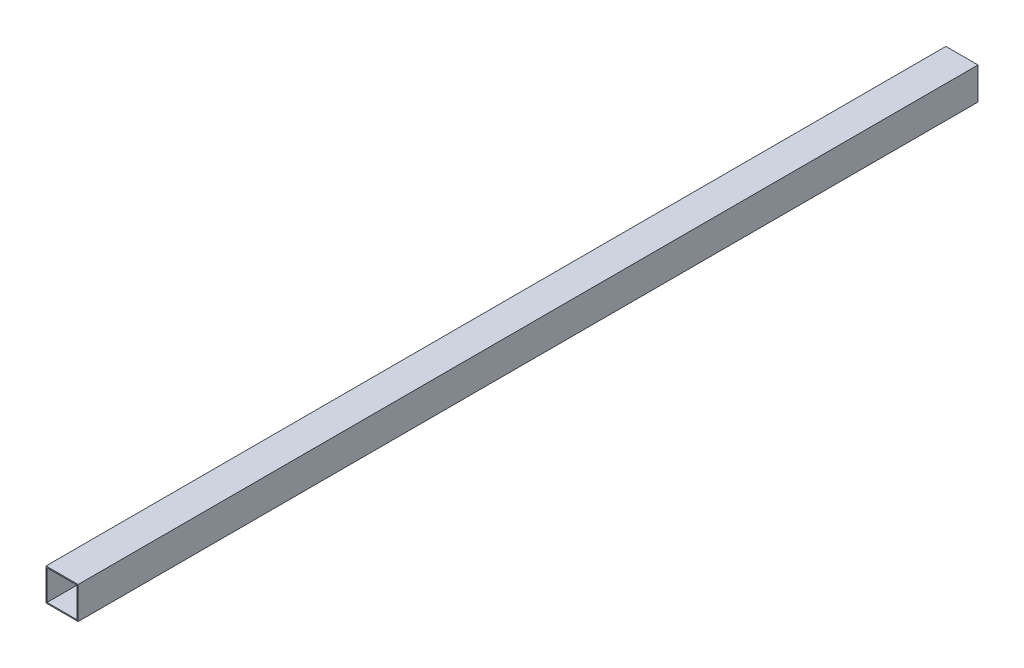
ISO-10303-21;
HEADER;
FILE_DESCRIPTION(('STEP AP214'),'2;1');
FILE_NAME('part.step','',(''),(''),'','','');
FILE_SCHEMA(('AUTOMOTIVE_DESIGN { 1 0 10303 214 1 1 1 1 }'));
ENDSEC;
DATA;
#1=APPLICATION_CONTEXT('core data for automotive mechanical design processes');
#2=APPLICATION_PROTOCOL_DEFINITION('international standard','automotive_design',2000,#1);
#3=PRODUCT_CONTEXT('',#1,'mechanical');
#4=PRODUCT('Part','Part','',(#3));
#5=PRODUCT_RELATED_PRODUCT_CATEGORY('part','',(#4));
#6=PRODUCT_DEFINITION_FORMATION('','',#4);
#7=PRODUCT_DEFINITION_CONTEXT('part definition',#1,'design');
#8=PRODUCT_DEFINITION('design','',#6,#7);
#9=PRODUCT_DEFINITION_SHAPE('','',#8);
#10=(LENGTH_UNIT() NAMED_UNIT(*) SI_UNIT(.MILLI.,.METRE.));
#11=(NAMED_UNIT(*) PLANE_ANGLE_UNIT() SI_UNIT($,.RADIAN.));
#12=(NAMED_UNIT(*) SI_UNIT($,.STERADIAN.) SOLID_ANGLE_UNIT());
#13=UNCERTAINTY_MEASURE_WITH_UNIT(LENGTH_MEASURE(1.E-05),#10,'distance_accuracy_value','');
#14=(GEOMETRIC_REPRESENTATION_CONTEXT(3) GLOBAL_UNCERTAINTY_ASSIGNED_CONTEXT((#13)) GLOBAL_UNIT_ASSIGNED_CONTEXT((#10,
#11,#12)) REPRESENTATION_CONTEXT('',''));
#15=CARTESIAN_POINT('',(0.,0.,0.));
#16=DIRECTION('',(0.,0.,1.));
#17=DIRECTION('',(1.,0.,0.));
#18=AXIS2_PLACEMENT_3D('',#15,#16,#17);
#19=CARTESIAN_POINT('',(1.11022302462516E-13,0.,840.));
#20=DIRECTION('',(0.,0.,1.));
#21=DIRECTION('',(1.,0.,0.));
#22=AXIS2_PLACEMENT_3D('',#19,#20,#21);
#23=PLANE('',#22);
#24=DIRECTION('',(0.,1.,0.));
#25=VECTOR('',#24,1.);
#26=CARTESIAN_POINT('',(15.0000000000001,-14.9999999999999,840.));
#27=LINE('',#26,#25);
#28=CARTESIAN_POINT('',(15.0000000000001,-14.9999999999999,840.));
#29=VERTEX_POINT('',#28);
#30=CARTESIAN_POINT('',(14.9999999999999,15.,840.));
#31=VERTEX_POINT('',#30);
#32=EDGE_CURVE('E161',#29,#31,#27,.T.);
#33=ORIENTED_EDGE('',*,*,#32,.T.);
#34=DIRECTION('',(-1.,0.,0.));
#35=VECTOR('',#34,1.);
#36=CARTESIAN_POINT('',(-14.9999999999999,15.0000000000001,840.));
#37=LINE('',#36,#35);
#38=CARTESIAN_POINT('',(-14.9999999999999,15.0000000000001,840.));
#39=VERTEX_POINT('',#38);
#40=EDGE_CURVE('E164',#31,#39,#37,.T.);
#41=ORIENTED_EDGE('',*,*,#40,.T.);
#42=DIRECTION('',(0.,-1.,0.));
#43=VECTOR('',#42,1.);
#44=CARTESIAN_POINT('',(-14.9999999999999,-15.,840.));
#45=LINE('',#44,#43);
#46=CARTESIAN_POINT('',(-14.9999999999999,-15.,840.));
#47=VERTEX_POINT('',#46);
#48=EDGE_CURVE('E167',#39,#47,#45,.T.);
#49=ORIENTED_EDGE('',*,*,#48,.T.);
#50=DIRECTION('',(1.,0.,0.));
#51=VECTOR('',#50,1.);
#52=CARTESIAN_POINT('',(-14.9999999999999,-15.,840.));
#53=LINE('',#52,#51);
#54=EDGE_CURVE('E169',#47,#29,#53,.T.);
#55=ORIENTED_EDGE('',*,*,#54,.T.);
#56=EDGE_LOOP('',(#33,#41,#49,#55));
#57=FACE_BOUND('',#56,.T.);
#58=DIRECTION('',(-1.,0.,0.));
#59=VECTOR('',#58,1.);
#60=CARTESIAN_POINT('',(1.11022302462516E-13,14.,840.));
#61=LINE('',#60,#59);
#62=CARTESIAN_POINT('',(13.9999999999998,14.,840.));
#63=VERTEX_POINT('',#62);
#64=CARTESIAN_POINT('',(-14.0000000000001,14.0000000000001,840.));
#65=VERTEX_POINT('',#64);
#66=EDGE_CURVE('E133',#63,#65,#61,.T.);
#67=ORIENTED_EDGE('',*,*,#66,.F.);
#68=DIRECTION('',(0.,1.,0.));
#69=VECTOR('',#68,1.);
#70=CARTESIAN_POINT('',(14.0000000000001,0.,840.));
#71=LINE('',#70,#69);
#72=CARTESIAN_POINT('',(14.,-14.,840.));
#73=VERTEX_POINT('',#72);
#74=EDGE_CURVE('E125',#73,#63,#71,.T.);
#75=ORIENTED_EDGE('',*,*,#74,.F.);
#76=DIRECTION('',(1.,0.,0.));
#77=VECTOR('',#76,1.);
#78=CARTESIAN_POINT('',(0.,-14.,840.));
#79=LINE('',#78,#77);
#80=CARTESIAN_POINT('',(-14.,-14.,840.));
#81=VERTEX_POINT('',#80);
#82=EDGE_CURVE('E147',#81,#73,#79,.T.);
#83=ORIENTED_EDGE('',*,*,#82,.F.);
#84=DIRECTION('',(0.,-1.,0.));
#85=VECTOR('',#84,1.);
#86=CARTESIAN_POINT('',(-13.9999999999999,0.,840.));
#87=LINE('',#86,#85);
#88=EDGE_CURVE('E145',#65,#81,#87,.T.);
#89=ORIENTED_EDGE('',*,*,#88,.F.);
#90=EDGE_LOOP('',(#67,#75,#83,#89));
#91=FACE_BOUND('',#90,.T.);
#92=ADVANCED_FACE('F60',(#57,#91),#23,.T.);
#93=CARTESIAN_POINT('',(0.,0.,0.));
#94=DIRECTION('',(0.,0.,1.));
#95=DIRECTION('',(1.,0.,0.));
#96=AXIS2_PLACEMENT_3D('',#93,#94,#95);
#97=PLANE('',#96);
#98=DIRECTION('',(0.,1.,0.));
#99=VECTOR('',#98,1.);
#100=CARTESIAN_POINT('',(15.0000000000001,-15.,0.));
#101=LINE('',#100,#99);
#102=CARTESIAN_POINT('',(15.0000000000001,-15.,0.));
#103=VERTEX_POINT('',#102);
#104=CARTESIAN_POINT('',(15.,15.0000000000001,0.));
#105=VERTEX_POINT('',#104);
#106=EDGE_CURVE('E141',#103,#105,#101,.T.);
#107=ORIENTED_EDGE('',*,*,#106,.F.);
#108=DIRECTION('',(1.,0.,0.));
#109=VECTOR('',#108,1.);
#110=CARTESIAN_POINT('',(-15.0000000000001,-15.,0.));
#111=LINE('',#110,#109);
#112=CARTESIAN_POINT('',(-15.0000000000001,-15.,0.));
#113=VERTEX_POINT('',#112);
#114=EDGE_CURVE('E165',#113,#103,#111,.T.);
#115=ORIENTED_EDGE('',*,*,#114,.F.);
#116=DIRECTION('',(0.,-1.,0.));
#117=VECTOR('',#116,1.);
#118=CARTESIAN_POINT('',(-15.0000000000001,-15.,0.));
#119=LINE('',#118,#117);
#120=CARTESIAN_POINT('',(-14.9999999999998,15.,0.));
#121=VERTEX_POINT('',#120);
#122=EDGE_CURVE('E176',#121,#113,#119,.T.);
#123=ORIENTED_EDGE('',*,*,#122,.F.);
#124=DIRECTION('',(-1.,0.,0.));
#125=VECTOR('',#124,1.);
#126=CARTESIAN_POINT('',(-14.9999999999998,15.,0.));
#127=LINE('',#126,#125);
#128=EDGE_CURVE('E174',#105,#121,#127,.T.);
#129=ORIENTED_EDGE('',*,*,#128,.F.);
#130=EDGE_LOOP('',(#107,#115,#123,#129));
#131=FACE_BOUND('',#130,.T.);
#132=DIRECTION('',(0.,1.,0.));
#133=VECTOR('',#132,1.);
#134=CARTESIAN_POINT('',(14.0000000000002,0.,0.));
#135=LINE('',#134,#133);
#136=CARTESIAN_POINT('',(14.0000000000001,-13.9999999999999,0.));
#137=VERTEX_POINT('',#136);
#138=CARTESIAN_POINT('',(14.0000000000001,14.0000000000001,0.));
#139=VERTEX_POINT('',#138);
#140=EDGE_CURVE('E83',#137,#139,#135,.T.);
#141=ORIENTED_EDGE('',*,*,#140,.T.);
#142=DIRECTION('',(-1.,0.,0.));
#143=VECTOR('',#142,1.);
#144=CARTESIAN_POINT('',(-1.11022302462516E-13,14.,0.));
#145=LINE('',#144,#143);
#146=CARTESIAN_POINT('',(-13.9999999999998,14.,0.));
#147=VERTEX_POINT('',#146);
#148=EDGE_CURVE('E140',#139,#147,#145,.T.);
#149=ORIENTED_EDGE('',*,*,#148,.T.);
#150=DIRECTION('',(0.,-1.,0.));
#151=VECTOR('',#150,1.);
#152=CARTESIAN_POINT('',(-14.0000000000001,0.,0.));
#153=LINE('',#152,#151);
#154=CARTESIAN_POINT('',(-13.9999999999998,-14.,1.11022302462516E-13));
#155=VERTEX_POINT('',#154);
#156=EDGE_CURVE('E153',#147,#155,#153,.T.);
#157=ORIENTED_EDGE('',*,*,#156,.T.);
#158=DIRECTION('',(1.,0.,0.));
#159=VECTOR('',#158,1.);
#160=CARTESIAN_POINT('',(3.33066907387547E-13,-13.9999999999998,1.66533453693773E-13));
#161=LINE('',#160,#159);
#162=EDGE_CURVE('E134',#155,#137,#161,.T.);
#163=ORIENTED_EDGE('',*,*,#162,.T.);
#164=EDGE_LOOP('',(#141,#149,#157,#163));
#165=FACE_BOUND('',#164,.T.);
#166=ADVANCED_FACE('F194',(#131,#165),#97,.F.);
#167=CARTESIAN_POINT('',(15.0000000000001,-14.9999999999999,840.));
#168=DIRECTION('',(-1.,0.,0.));
#169=DIRECTION('',(0.,0.,1.));
#170=AXIS2_PLACEMENT_3D('',#167,#168,#169);
#171=PLANE('',#170);
#172=ORIENTED_EDGE('',*,*,#106,.T.);
#173=DIRECTION('',(0.,0.,-1.));
#174=VECTOR('',#173,1.);
#175=CARTESIAN_POINT('',(14.9999999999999,15.,840.));
#176=LINE('',#175,#174);
#177=EDGE_CURVE('E12',#31,#105,#176,.T.);
#178=ORIENTED_EDGE('',*,*,#177,.F.);
#179=ORIENTED_EDGE('',*,*,#32,.F.);
#180=DIRECTION('',(0.,0.,-1.));
#181=VECTOR('',#180,1.);
#182=CARTESIAN_POINT('',(15.0000000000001,-14.9999999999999,840.));
#183=LINE('',#182,#181);
#184=EDGE_CURVE('E171',#29,#103,#183,.T.);
#185=ORIENTED_EDGE('',*,*,#184,.T.);
#186=EDGE_LOOP('',(#172,#178,#179,#185));
#187=FACE_BOUND('',#186,.T.);
#188=ADVANCED_FACE('F62',(#187),#171,.F.);
#189=CARTESIAN_POINT('',(-14.9999999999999,15.0000000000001,840.));
#190=DIRECTION('',(0.,-1.,0.));
#191=DIRECTION('',(0.,0.,-1.));
#192=AXIS2_PLACEMENT_3D('',#189,#190,#191);
#193=PLANE('',#192);
#194=ORIENTED_EDGE('',*,*,#128,.T.);
#195=DIRECTION('',(0.,0.,-1.));
#196=VECTOR('',#195,1.);
#197=CARTESIAN_POINT('',(-14.9999999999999,15.0000000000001,840.));
#198=LINE('',#197,#196);
#199=EDGE_CURVE('E68',#39,#121,#198,.T.);
#200=ORIENTED_EDGE('',*,*,#199,.F.);
#201=ORIENTED_EDGE('',*,*,#40,.F.);
#202=ORIENTED_EDGE('',*,*,#177,.T.);
#203=EDGE_LOOP('',(#194,#200,#201,#202));
#204=FACE_BOUND('',#203,.T.);
#205=ADVANCED_FACE('F204',(#204),#193,.F.);
#206=CARTESIAN_POINT('',(-14.9999999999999,-15.,840.));
#207=DIRECTION('',(1.,0.,0.));
#208=DIRECTION('',(0.,0.,-1.));
#209=AXIS2_PLACEMENT_3D('',#206,#207,#208);
#210=PLANE('',#209);
#211=ORIENTED_EDGE('',*,*,#122,.T.);
#212=DIRECTION('',(0.,0.,-1.));
#213=VECTOR('',#212,1.);
#214=CARTESIAN_POINT('',(-14.9999999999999,-15.,840.));
#215=LINE('',#214,#213);
#216=EDGE_CURVE('E181',#47,#113,#215,.T.);
#217=ORIENTED_EDGE('',*,*,#216,.F.);
#218=ORIENTED_EDGE('',*,*,#48,.F.);
#219=ORIENTED_EDGE('',*,*,#199,.T.);
#220=EDGE_LOOP('',(#211,#217,#218,#219));
#221=FACE_BOUND('',#220,.T.);
#222=ADVANCED_FACE('F188',(#221),#210,.F.);
#223=CARTESIAN_POINT('',(-14.9999999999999,-15.,840.));
#224=DIRECTION('',(0.,1.,0.));
#225=DIRECTION('',(0.,0.,1.));
#226=AXIS2_PLACEMENT_3D('',#223,#224,#225);
#227=PLANE('',#226);
#228=ORIENTED_EDGE('',*,*,#114,.T.);
#229=ORIENTED_EDGE('',*,*,#184,.F.);
#230=ORIENTED_EDGE('',*,*,#54,.F.);
#231=ORIENTED_EDGE('',*,*,#216,.T.);
#232=EDGE_LOOP('',(#228,#229,#230,#231));
#233=FACE_BOUND('',#232,.T.);
#234=ADVANCED_FACE('F198',(#233),#227,.F.);
#235=CARTESIAN_POINT('',(14.0000000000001,0.,840.));
#236=DIRECTION('',(-1.,0.,0.));
#237=DIRECTION('',(0.,0.,1.));
#238=AXIS2_PLACEMENT_3D('',#235,#236,#237);
#239=PLANE('',#238);
#240=ORIENTED_EDGE('',*,*,#140,.F.);
#241=DIRECTION('',(0.,0.,-1.));
#242=VECTOR('',#241,1.);
#243=CARTESIAN_POINT('',(14.,-14.,840.));
#244=LINE('',#243,#242);
#245=EDGE_CURVE('E129',#73,#137,#244,.T.);
#246=ORIENTED_EDGE('',*,*,#245,.F.);
#247=ORIENTED_EDGE('',*,*,#74,.T.);
#248=DIRECTION('',(0.,0.,-1.));
#249=VECTOR('',#248,1.);
#250=CARTESIAN_POINT('',(13.9999999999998,14.,840.));
#251=LINE('',#250,#249);
#252=EDGE_CURVE('E128',#63,#139,#251,.T.);
#253=ORIENTED_EDGE('',*,*,#252,.T.);
#254=EDGE_LOOP('',(#240,#246,#247,#253));
#255=FACE_BOUND('',#254,.T.);
#256=ADVANCED_FACE('F127',(#255),#239,.T.);
#257=CARTESIAN_POINT('',(1.11022302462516E-13,14.,840.));
#258=DIRECTION('',(0.,-1.,0.));
#259=DIRECTION('',(0.,0.,-1.));
#260=AXIS2_PLACEMENT_3D('',#257,#258,#259);
#261=PLANE('',#260);
#262=ORIENTED_EDGE('',*,*,#148,.F.);
#263=ORIENTED_EDGE('',*,*,#252,.F.);
#264=ORIENTED_EDGE('',*,*,#66,.T.);
#265=DIRECTION('',(0.,0.,-1.));
#266=VECTOR('',#265,1.);
#267=CARTESIAN_POINT('',(-14.0000000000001,14.0000000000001,840.));
#268=LINE('',#267,#266);
#269=EDGE_CURVE('E142',#65,#147,#268,.T.);
#270=ORIENTED_EDGE('',*,*,#269,.T.);
#271=EDGE_LOOP('',(#262,#263,#264,#270));
#272=FACE_BOUND('',#271,.T.);
#273=ADVANCED_FACE('F137',(#272),#261,.T.);
#274=CARTESIAN_POINT('',(-13.9999999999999,0.,840.));
#275=DIRECTION('',(1.,0.,0.));
#276=DIRECTION('',(0.,0.,-1.));
#277=AXIS2_PLACEMENT_3D('',#274,#275,#276);
#278=PLANE('',#277);
#279=ORIENTED_EDGE('',*,*,#156,.F.);
#280=ORIENTED_EDGE('',*,*,#269,.F.);
#281=ORIENTED_EDGE('',*,*,#88,.T.);
#282=DIRECTION('',(0.,0.,-1.));
#283=VECTOR('',#282,1.);
#284=CARTESIAN_POINT('',(-14.,-14.,840.));
#285=LINE('',#284,#283);
#286=EDGE_CURVE('E75',#81,#155,#285,.T.);
#287=ORIENTED_EDGE('',*,*,#286,.T.);
#288=EDGE_LOOP('',(#279,#280,#281,#287));
#289=FACE_BOUND('',#288,.T.);
#290=ADVANCED_FACE('F227',(#289),#278,.T.);
#291=CARTESIAN_POINT('',(0.,-14.,840.));
#292=DIRECTION('',(0.,1.,0.));
#293=DIRECTION('',(0.,0.,1.));
#294=AXIS2_PLACEMENT_3D('',#291,#292,#293);
#295=PLANE('',#294);
#296=ORIENTED_EDGE('',*,*,#162,.F.);
#297=ORIENTED_EDGE('',*,*,#286,.F.);
#298=ORIENTED_EDGE('',*,*,#82,.T.);
#299=ORIENTED_EDGE('',*,*,#245,.T.);
#300=EDGE_LOOP('',(#296,#297,#298,#299));
#301=FACE_BOUND('',#300,.T.);
#302=ADVANCED_FACE('F231',(#301),#295,.T.);
#303=CLOSED_SHELL('',(#92,#166,#188,#205,#222,#234,#256,#273,#290,#302));
#304=MANIFOLD_SOLID_BREP('B2',#303);
#305=ADVANCED_BREP_SHAPE_REPRESENTATION('',(#18,#304),#14);
#306=SHAPE_DEFINITION_REPRESENTATION(#9,#305);
ENDSEC;
END-ISO-10303-21;
